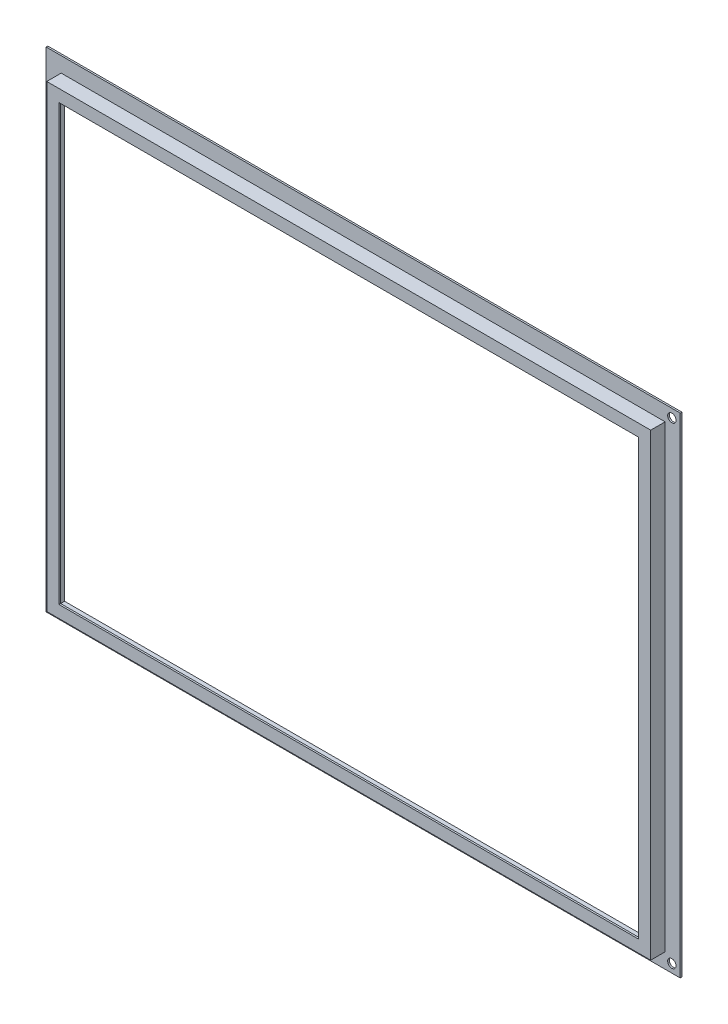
from build123d import *

# Parameters (mm, degrees)
SKETCH1_W                = 357.939537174
SKETCH1_H                = 271.5806171
SKETCH1_W_2              = 345.439537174
SKETCH1_H_2              = 259.0806171
BASE_EXTRUDE_DEPTH       = 1
SKETCH2_W                = 359.939537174
SKETCH2_H                = 273.5806171
SKETCH2_W_2              = 357.939537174
SKETCH2_H_2              = 271.5806171
BOSS_EXTRUDE_THIN1_DEPTH = 8.6
CUT_EXTRUDE1_REACH       = 355.128
SKETCH3_W                = 2.5
SKETCH3_H                = 50.5
SKETCH4_W                = 377.939537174
SKETCH4_H                = 291.5806171
SKETCH4_W_2              = 357.939537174
SKETCH4_H_2              = 271.5806171
BOSS_EXTRUDE1_DEPTH      = 1
SKETCH5_R                = 2.5
CUT_EXTRUDE2_DEPTH       = 239.865124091


with BuildPart() as part:
    # Sketch1 → Base-Extrude (new body)
    with BuildSketch(Plane.XY):
        Rectangle(SKETCH1_W, SKETCH1_H)
        Rectangle(SKETCH1_W_2, SKETCH1_H_2, mode=Mode.SUBTRACT)
    extrude(amount=BASE_EXTRUDE_DEPTH)

    # Sketch2 → Boss-Extrude-Thin1 (add)
    with BuildSketch(Plane.XY.offset(1)):
        Rectangle(SKETCH2_W, SKETCH2_H)
        Rectangle(SKETCH2_W_2, SKETCH2_H_2, mode=Mode.SUBTRACT)
    extrude(amount=-BOSS_EXTRUDE_THIN1_DEPTH)

    # Sketch3 → Cut-Extrude1 (cut, up to next)
    with BuildSketch(Plane(origin=(43.179460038, -136.79030855, 0), x_dir=(0, 0, -1), z_dir=(0, 1, 0)), mode=Mode.PRIVATE) as cut_extrude1_sk1:
        with Locations((3.175, -84.54030855)):
            Rectangle(SKETCH3_W, SKETCH3_H)
    cut_extrude1_tool1 = extrude(cut_extrude1_sk1.sketch, amount=CUT_EXTRUDE1_REACH, mode=Mode.PRIVATE) & part.part
    add(cut_extrude1_tool1.solids().sort_by_distance((127.719769, -136.790309, -3.175))[0], mode=Mode.SUBTRACT)

    # Sketch4 → Boss-Extrude1 (add)
    with BuildSketch(Plane(origin=(0, 0, -7.6), x_dir=(-1, 0, 0), z_dir=(0, 0, -1))):
        Rectangle(SKETCH4_W, SKETCH4_H)
        Rectangle(SKETCH4_W_2, SKETCH4_H_2, mode=Mode.SUBTRACT)
    extrude(amount=BOSS_EXTRUDE1_DEPTH)

    # Sketch5 → Cut-Extrude2 (cut, through all)
    with BuildSketch(Plane(origin=(0, 0, -8.6), x_dir=(-1, 0, 0), z_dir=(0, 0, -1))):
        with Locations((-183.969768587, 140.79030855)):
            Circle(SKETCH5_R)
        with Locations((-183.969768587, -140.79030855)):
            Circle(SKETCH5_R)
    extrude(amount=-CUT_EXTRUDE2_DEPTH, mode=Mode.SUBTRACT)


solid = part.part
